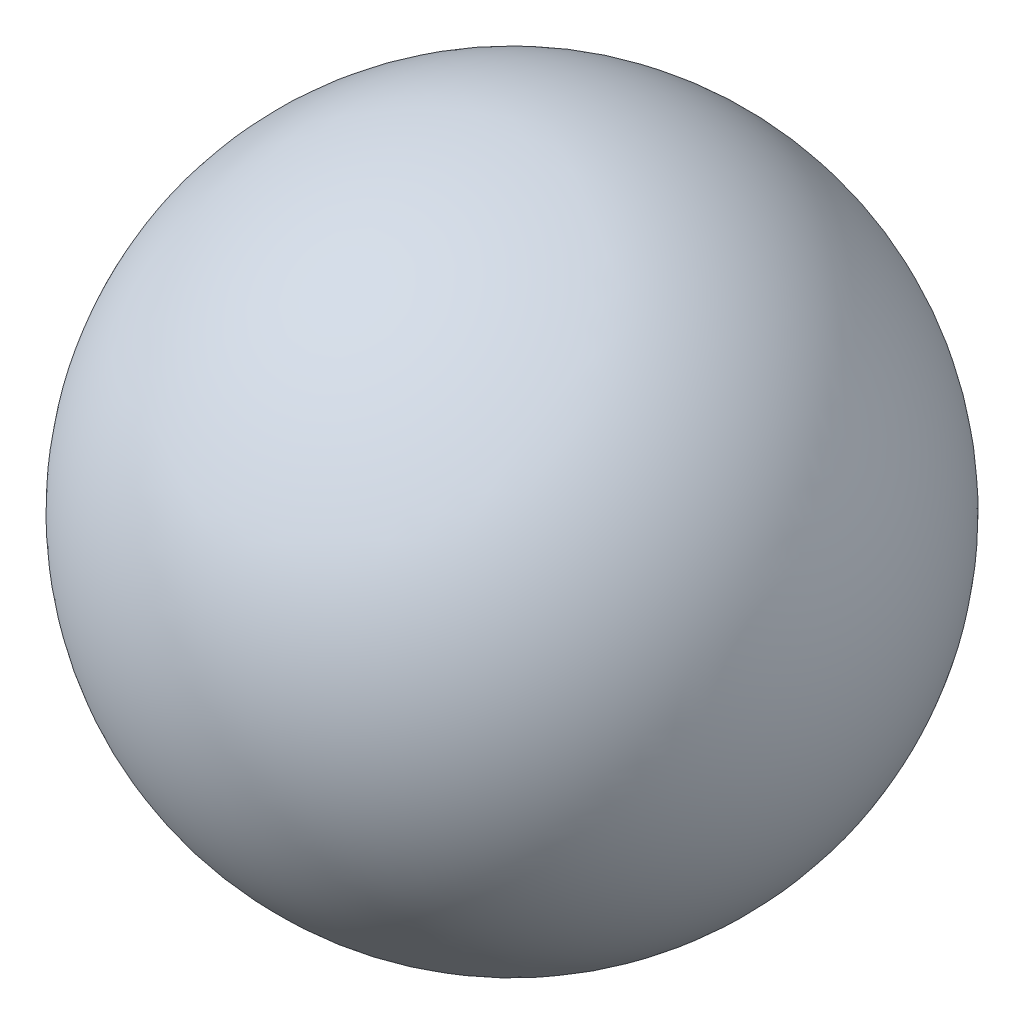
ISO-10303-21;
HEADER;
FILE_DESCRIPTION(('STEP AP214'),'2;1');
FILE_NAME('part.step','',(''),(''),'','','');
FILE_SCHEMA(('AUTOMOTIVE_DESIGN { 1 0 10303 214 1 1 1 1 }'));
ENDSEC;
DATA;
#1=APPLICATION_CONTEXT('core data for automotive mechanical design processes');
#2=APPLICATION_PROTOCOL_DEFINITION('international standard','automotive_design',2000,#1);
#3=PRODUCT_CONTEXT('',#1,'mechanical');
#4=PRODUCT('Part','Part','',(#3));
#5=PRODUCT_RELATED_PRODUCT_CATEGORY('part','',(#4));
#6=PRODUCT_DEFINITION_FORMATION('','',#4);
#7=PRODUCT_DEFINITION_CONTEXT('part definition',#1,'design');
#8=PRODUCT_DEFINITION('design','',#6,#7);
#9=PRODUCT_DEFINITION_SHAPE('','',#8);
#10=(LENGTH_UNIT() NAMED_UNIT(*) SI_UNIT(.MILLI.,.METRE.));
#11=(NAMED_UNIT(*) PLANE_ANGLE_UNIT() SI_UNIT($,.RADIAN.));
#12=(NAMED_UNIT(*) SI_UNIT($,.STERADIAN.) SOLID_ANGLE_UNIT());
#13=UNCERTAINTY_MEASURE_WITH_UNIT(LENGTH_MEASURE(1.E-05),#10,'distance_accuracy_value','');
#14=(GEOMETRIC_REPRESENTATION_CONTEXT(3) GLOBAL_UNCERTAINTY_ASSIGNED_CONTEXT((#13)) GLOBAL_UNIT_ASSIGNED_CONTEXT((#10,
#11,#12)) REPRESENTATION_CONTEXT('',''));
#15=CARTESIAN_POINT('',(0.,0.,0.));
#16=DIRECTION('',(0.,0.,1.));
#17=DIRECTION('',(1.,0.,0.));
#18=AXIS2_PLACEMENT_3D('',#15,#16,#17);
#19=CARTESIAN_POINT('',(0.,0.,0.));
#20=DIRECTION('',(-1.,0.,0.));
#21=DIRECTION('',(0.,0.,-1.));
#22=AXIS2_PLACEMENT_3D('',#19,#20,#21);
#23=SPHERICAL_SURFACE('',#22,6.15);
#24=CARTESIAN_POINT('',(-6.15,0.,0.));
#25=VERTEX_POINT('',#24);
#26=VERTEX_LOOP('',#25);
#27=FACE_BOUND('',#26,.T.);
#28=ADVANCED_FACE('F27',(#27),#23,.T.);
#29=CLOSED_SHELL('',(#28));
#30=MANIFOLD_SOLID_BREP('B2',#29);
#31=ADVANCED_BREP_SHAPE_REPRESENTATION('',(#18,#30),#14);
#32=SHAPE_DEFINITION_REPRESENTATION(#9,#31);
ENDSEC;
END-ISO-10303-21;
